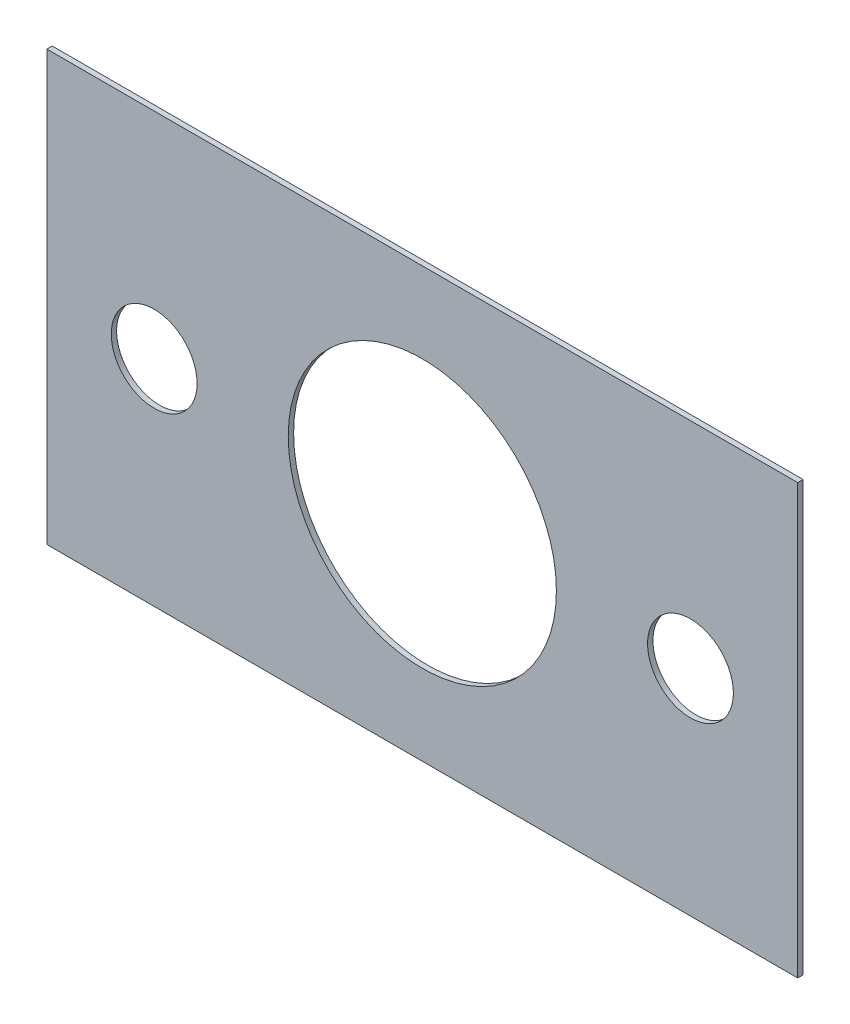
from build123d import *

# Parameters (mm, degrees)
CROQUIS1_W     = 70
CROQUIS1_H     = 40
CROQUIS1_R     = 12.5
CROQUIS1_R_2   = 4
EXTRUIR1_DEPTH = 0.5


with BuildPart() as part:
    # Croquis1 → Extruir1 (new body)
    with BuildSketch(Plane.XY):
        Rectangle(CROQUIS1_W, CROQUIS1_H)
        Circle(CROQUIS1_R, mode=Mode.SUBTRACT)
        with Locations((-25, 0)):
            Circle(CROQUIS1_R_2, mode=Mode.SUBTRACT)
        with Locations((25, 0)):
            Circle(CROQUIS1_R_2, mode=Mode.SUBTRACT)
    extrude(amount=EXTRUIR1_DEPTH)


solid = part.part
